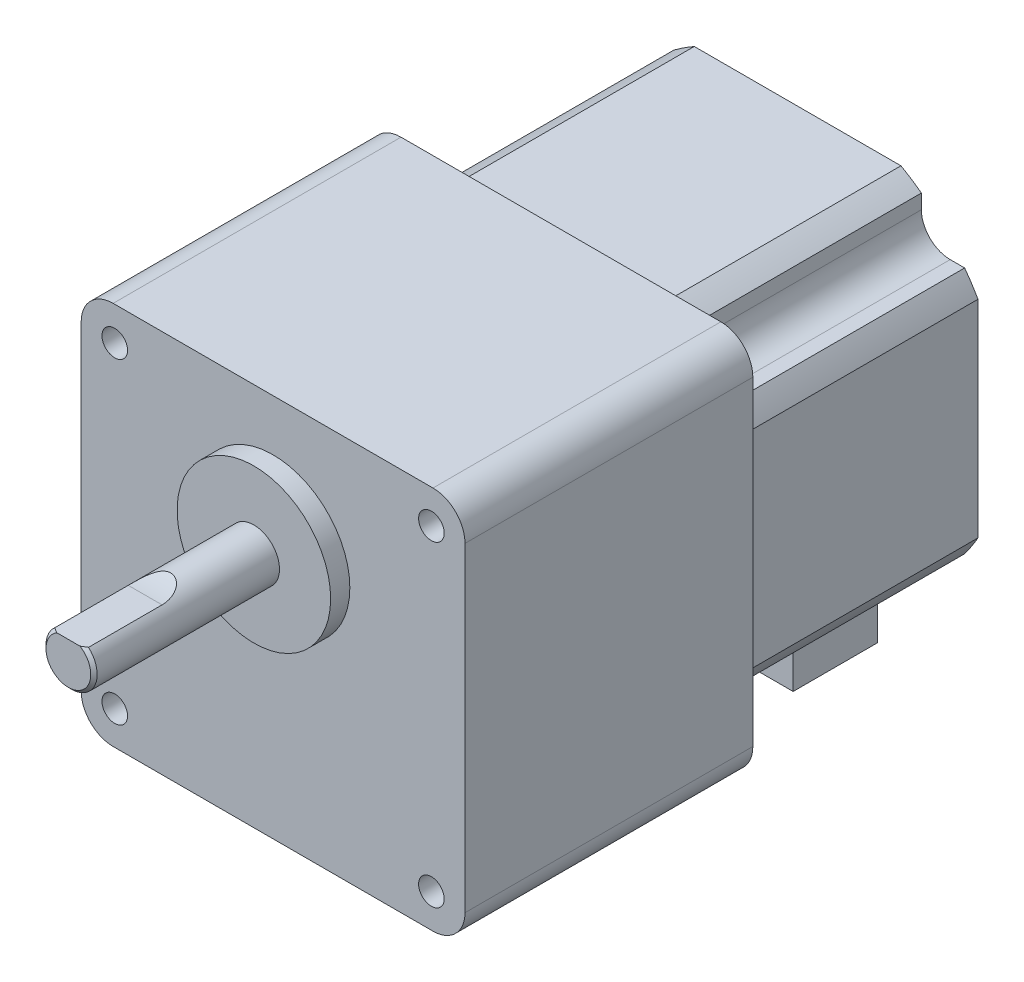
from build123d import *

# Parameters (mm, degrees)
SKETCH1_R       = 12
EXTRUDE1_DEPTH  = 3
SKETCH2_R       = 4
EXTRUDE2_DEPTH  = 29
CHAMFER1_SIZE   = 0.5
EXTRUDE3_DEPTH  = 5
EXTRUDE4_DEPTH  = 45
SKETCH6_W       = 38.7
SKETCH6_H       = 38.7
EXTRUDE6_DEPTH  = 37
FILLET1_R       = 4.5
SKETCH9_W       = 25
SKETCH9_H       = 13.2
EXTRUDE9_DEPTH  = 10
SKETCH10_R      = 2
EXTRUDE10_DEPTH = 8


with BuildPart() as part:
    # Sketch1 → Extrude1 (new body)
    with BuildSketch(Plane.XY):
        Circle(SKETCH1_R)
    extrude(amount=EXTRUDE1_DEPTH)

    # Sketch2 → Extrude2 (add)
    with BuildSketch(Plane.XY.offset(3)):
        with Locations(Location((0, 0, 0), (0, 0, 180))):
            Circle(SKETCH2_R)
    extrude(amount=EXTRUDE2_DEPTH)

    # Chamfer1
    chamfer1_edges = [part.edges().sort_by_distance(p)[0] for p in [
        (4, 0, 32),
    ]]
    chamfer(chamfer1_edges, length=CHAMFER1_SIZE)

    # Sketch3 → Extrude3 (cut, symmetric)
    with BuildSketch(Plane(origin=(0, 0, 0), x_dir=(0, 0, -1), z_dir=(1, 0, 0))):
        with BuildLine():
            Line((-32, 11.5), (-32, 3))
            Line((-32, 3), (-20, 3))
            ThreePointArc((-20, 3), (-26.01040764, 5.48959236), (-28.5, 11.5))
            Line((-28.5, 11.5), (-32, 11.5))
        make_face()
        with BuildLine():
            ThreePointArc((-28.5, 11.5), (-26.01040764, 5.48959236), (-20, 3))
            Line((-20, 3), (-20, 11.5))
            Line((-20, 11.5), (-28.5, 11.5))
        make_face()
        with BuildLine():
            Line((-20, 11.5), (-20, 3))
            ThreePointArc((-20, 3), (-13.98959236, 5.48959236), (-11.5, 11.5))
            ThreePointArc((-11.5, 11.5), (-20, 20), (-28.5, 11.5))
            Line((-28.5, 11.5), (-20, 11.5))
        make_face()
        with BuildLine():
            ThreePointArc((-28.5, 11.5), (-26.01040764, 5.48959236), (-20, 3))
            Line((-20, 3), (-20, 11.5))
            Line((-20, 11.5), (-28.5, 11.5))
        make_face()
        with BuildLine():
            Line((-20, 11.5), (-20, 3))
            ThreePointArc((-20, 3), (-13.98959236, 5.48959236), (-11.5, 11.5))
            ThreePointArc((-11.5, 11.5), (-20, 20), (-28.5, 11.5))
            Line((-28.5, 11.5), (-20, 11.5))
        make_face()
    extrude(amount=EXTRUDE3_DEPTH, both=True, mode=Mode.SUBTRACT)

    # Sketch4 → Extrude4 (add)
    with BuildSketch(Plane(origin=(0, 0, 0), x_dir=(-1, 0, 0), z_dir=(0, 0, -1))):
        with BuildLine():
            Line((-25, -40), (25, -40))
            ThreePointArc((25, -40), (28.535533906, -38.535533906), (30, -35))
            Line((30, -35), (30, 15))
            ThreePointArc((30, 15), (28.535533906, 18.535533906), (25, 20))
            Line((25, 20), (-25, 20))
            ThreePointArc((-25, 20), (-28.535533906, 18.535533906), (-30, 15))
            Line((-30, 15), (-30, -35))
            ThreePointArc((-30, -35), (-28.535533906, -38.535533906), (-25, -40))
        make_face()
    extrude(amount=EXTRUDE4_DEPTH)

    # Sketch6 → Extrude6 (add)
    with BuildSketch(Plane(origin=(0, 0, -45), x_dir=(-1, 0, 0), z_dir=(0, 0, -1))):
        with BuildLine():
            Line((-26.111826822, -29.35), (-19.35, -29.35))
            Line((-19.35, -29.35), (-19.35, 9.35))
            Line((-19.35, 9.35), (-26.111826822, 9.35))
            ThreePointArc((-26.111826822, 9.35), (-27.202837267, 7.783577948), (-28.2, 6.155803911))
            Line((-28.2, 6.155803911), (-28.2, -26.155803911))
            ThreePointArc((-28.2, -26.155803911), (-27.202837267, -27.783577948), (-26.111826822, -29.35))
        make_face()
        with BuildLine():
            Line((-19.35, 9.35), (19.35, 9.35))
            Line((19.35, 9.35), (19.35, 16.111826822))
            ThreePointArc((19.35, 16.111826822), (17.783577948, 17.202837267), (16.155803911, 18.2))
            Line((16.155803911, 18.2), (-16.155803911, 18.2))
            ThreePointArc((-16.155803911, 18.2), (-17.783577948, 17.202837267), (-19.35, 16.111826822))
            Line((-19.35, 16.111826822), (-19.35, 9.35))
        make_face()
        with BuildLine():
            Line((19.35, -29.35), (26.111826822, -29.35))
            ThreePointArc((26.111826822, -29.35), (27.202837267, -27.783577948), (28.2, -26.155803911))
            Line((28.2, -26.155803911), (28.2, 6.155803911))
            ThreePointArc((28.2, 6.155803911), (27.202837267, 7.783577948), (26.111826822, 9.35))
            Line((26.111826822, 9.35), (19.35, 9.35))
            Line((19.35, 9.35), (19.35, -29.35))
        make_face()
        with BuildLine():
            Line((19.35, -36.111826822), (19.35, -29.35))
            Line((19.35, -29.35), (-19.35, -29.35))
            Line((-19.35, -29.35), (-19.35, -36.111826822))
            ThreePointArc((-19.35, -36.111826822), (-17.783577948, -37.202837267), (-16.155803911, -38.2))
            Line((-16.155803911, -38.2), (16.155803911, -38.2))
            ThreePointArc((16.155803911, -38.2), (17.783577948, -37.202837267), (19.35, -36.111826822))
        make_face()
        with Locations((0, -10)):
            Rectangle(SKETCH6_W, SKETCH6_H)
    extrude(amount=EXTRUDE6_DEPTH)

    # Fillet1
    fillet1_edges = [part.edges().sort_by_distance(p)[0] for p in [
        (19.35, 9.35, -63.5),
        (19.35, -29.35, -63.5),
        (-19.35, -29.35, -63.5),
        (-19.35, 9.35, -63.5),
    ]]
    fillet(fillet1_edges, radius=FILLET1_R)

    # Sketch10 → Extrude10 (cut)
    with BuildSketch(Plane.XY):
        with Locations((24.748737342, 14.748737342)):
            Circle(SKETCH10_R)
        with Locations((-24.748737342, 14.748737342)):
            Circle(SKETCH10_R)
        with Locations((-24.748737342, -34.748737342)):
            Circle(SKETCH10_R)
        with Locations((24.748737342, -34.748737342)):
            Circle(SKETCH10_R)
    extrude(amount=-EXTRUDE10_DEPTH, mode=Mode.SUBTRACT)


with BuildPart() as body_2:
    # Sketch9 → Extrude9 (new body)
    with BuildSketch(Plane.XZ.offset(38.2)):
        with Locations((0, -75.4)):
            Rectangle(SKETCH9_W, SKETCH9_H)
    extrude(amount=EXTRUDE9_DEPTH)


solid = Compound([part.part, body_2.part])
